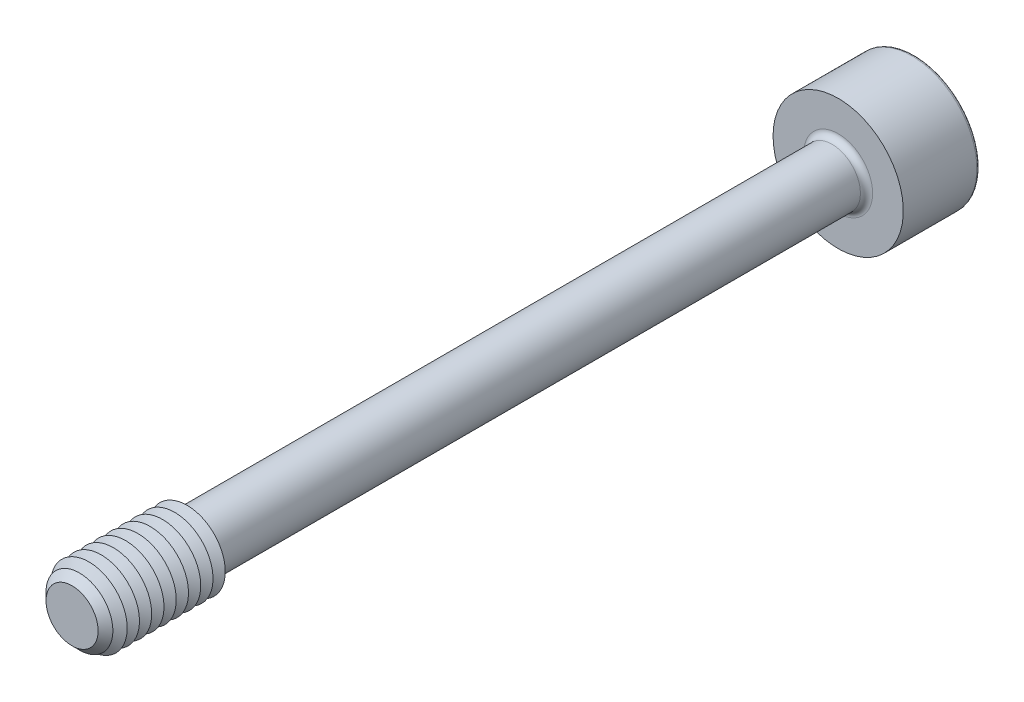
from build123d import *

# Parameters (mm, degrees)
SKETCH1_R       = 1.85
EXTRUDE1_DEPTH  = 25
CHAMFER1_SIZE   = 0.8
SKETCH3_R       = 4.25
EXTRUDE2_DEPTH  = 5
EXTRUDE3_DEPTH  = 4
FILLET1_R       = 0.4
FILLET2_R       = 0.2
LPATTERN1_COUNT = 9
LPATTERN1_PITCH = 0.8


with BuildPart() as part:
    # Sketch1 → Extrude1 (new, symmetric)
    with BuildSketch(Plane.XY):
        Circle(SKETCH1_R)
    extrude(amount=EXTRUDE1_DEPTH, both=True)

    # Sketch2 → Revolve1 (revolve)
    with BuildSketch(Plane(origin=(0, 0, 0), x_dir=(0, 0, -1), z_dir=(1, 0, 0))):
        Polygon((-25, 0), (-25, 2.5), (-17.5, 2.5), (-17.124722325, 1.85), (-17.124722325, 0), align=None)
    revolve(axis=Axis((0, 0, 17.124722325), (0, 0, 1)))

    # Chamfer1
    chamfer1_edges = [part.edges().sort_by_distance(p)[0] for p in [
        (0, -2.5, 25),
    ]]
    chamfer(chamfer1_edges, length=CHAMFER1_SIZE)

    # Sketch3 → Extrude2 (add)
    with BuildSketch(Plane(origin=(0, 0, -25), x_dir=(-1, 0, 0), z_dir=(0, 0, -1))):
        Circle(SKETCH3_R)
    extrude(amount=EXTRUDE2_DEPTH)

    # Sketch4 → Extrude3 (cut)
    with BuildSketch(Plane(origin=(-13.7, 0, -30), x_dir=(1, 0, 0), z_dir=(0, 0, 1))):
        Polygon((12.545299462, -2), (14.854700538, -2), (16.009401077, 0), (14.854700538, 2), (12.545299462, 2), (11.390598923, 0), align=None)
    extrude(amount=EXTRUDE3_DEPTH, mode=Mode.SUBTRACT)

    # Fillet1
    fillet1_edges = [part.edges().sort_by_distance(p)[0] for p in [
        (-1.85, 0, -25),
    ]]
    fillet(fillet1_edges, radius=FILLET1_R)

    # Fillet2
    fillet2_edges = [part.edges().sort_by_distance(p)[0] for p in [
        (4.25, 0, -30),
    ]]
    fillet(fillet2_edges, radius=FILLET2_R)

    # Sketch5 → Cut-Revolve1 (revolve, cut)
    with BuildSketch(Plane(origin=(0, 0, 0), x_dir=(0, 0, -1), z_dir=(1, 0, 0)), mode=Mode.PRIVATE) as cut_revolve1_sk:
        Polygon((26, 0), (26, -2), (24.845299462, 0), align=None)
    revolve(cut_revolve1_sk.sketch.rotate(Axis((0, 0, -24.845299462), (0, 0, -1)), 90), axis=Axis((0, 0, -24.845299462), (0, 0, -1)), mode=Mode.SUBTRACT)

    # Sketch7 → Cut-Revolve2 (revolve, cut)
    with BuildSketch(Plane(origin=(0, 0, 0), x_dir=(0, 0, -1), z_dir=(1, 0, 0)), mode=Mode.PRIVATE) as cut_revolve2_sk:
        Polygon((-17.5, 2.5), (-17.9, 1.807179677), (-18.3, 2.5), align=None)
    cut_revolve2 = revolve(cut_revolve2_sk.sketch.rotate(Axis((0, 0, -1.332048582), (0, 0, 1)), 90), axis=Axis((0, 0, -1.332048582), (0, 0, 1)), mode=Mode.SUBTRACT)

    # LPattern1: Cut-Revolve2 ×9
    with Locations(*[(0, 0, i * LPATTERN1_PITCH) for i in range(1, LPATTERN1_COUNT)]):
        add(cut_revolve2, mode=Mode.SUBTRACT)


solid = part.part
